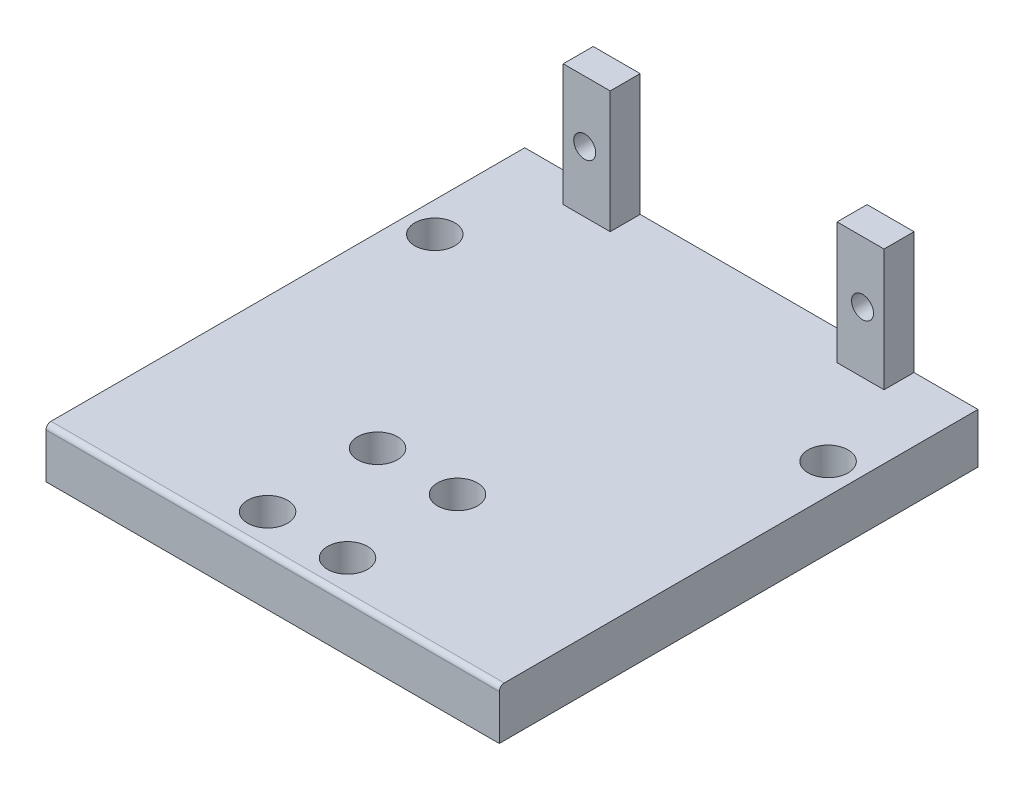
ISO-10303-21;
HEADER;
FILE_DESCRIPTION(('STEP AP214'),'2;1');
FILE_NAME('part.step','',(''),(''),'','','');
FILE_SCHEMA(('AUTOMOTIVE_DESIGN { 1 0 10303 214 1 1 1 1 }'));
ENDSEC;
DATA;
#1=APPLICATION_CONTEXT('core data for automotive mechanical design processes');
#2=APPLICATION_PROTOCOL_DEFINITION('international standard','automotive_design',2000,#1);
#3=PRODUCT_CONTEXT('',#1,'mechanical');
#4=PRODUCT('Part','Part','',(#3));
#5=PRODUCT_RELATED_PRODUCT_CATEGORY('part','',(#4));
#6=PRODUCT_DEFINITION_FORMATION('','',#4);
#7=PRODUCT_DEFINITION_CONTEXT('part definition',#1,'design');
#8=PRODUCT_DEFINITION('design','',#6,#7);
#9=PRODUCT_DEFINITION_SHAPE('','',#8);
#10=(LENGTH_UNIT() NAMED_UNIT(*) SI_UNIT(.MILLI.,.METRE.));
#11=(NAMED_UNIT(*) PLANE_ANGLE_UNIT() SI_UNIT($,.RADIAN.));
#12=(NAMED_UNIT(*) SI_UNIT($,.STERADIAN.) SOLID_ANGLE_UNIT());
#13=UNCERTAINTY_MEASURE_WITH_UNIT(LENGTH_MEASURE(1.E-05),#10,'distance_accuracy_value','');
#14=(GEOMETRIC_REPRESENTATION_CONTEXT(3) GLOBAL_UNCERTAINTY_ASSIGNED_CONTEXT((#13)) GLOBAL_UNIT_ASSIGNED_CONTEXT((#10,
#11,#12)) REPRESENTATION_CONTEXT('',''));
#15=CARTESIAN_POINT('',(0.,0.,0.));
#16=DIRECTION('',(0.,0.,1.));
#17=DIRECTION('',(1.,0.,0.));
#18=AXIS2_PLACEMENT_3D('',#15,#16,#17);
#19=CARTESIAN_POINT('',(0.,68.2,3.));
#20=DIRECTION('',(0.,1.,0.));
#21=DIRECTION('',(0.,0.,1.));
#22=AXIS2_PLACEMENT_3D('',#19,#20,#21);
#23=PLANE('',#22);
#24=DIRECTION('',(0.,0.,-1.));
#25=VECTOR('',#24,1.);
#26=CARTESIAN_POINT('',(49.5,68.2,47.9));
#27=LINE('',#26,#25);
#28=CARTESIAN_POINT('',(49.5,68.2,3.));
#29=VERTEX_POINT('',#28);
#30=CARTESIAN_POINT('',(49.5,68.2,0.));
#31=VERTEX_POINT('',#30);
#32=EDGE_CURVE('E184',#29,#31,#27,.T.);
#33=ORIENTED_EDGE('',*,*,#32,.F.);
#34=DIRECTION('',(1.,0.,0.));
#35=VECTOR('',#34,1.);
#36=CARTESIAN_POINT('',(0.,68.2,3.));
#37=LINE('',#36,#35);
#38=CARTESIAN_POINT('',(54.2,68.2,3.));
#39=VERTEX_POINT('',#38);
#40=EDGE_CURVE('E205',#29,#39,#37,.T.);
#41=ORIENTED_EDGE('',*,*,#40,.T.);
#42=DIRECTION('',(0.,0.,-1.));
#43=VECTOR('',#42,1.);
#44=CARTESIAN_POINT('',(54.2,68.2,3.));
#45=LINE('',#44,#43);
#46=CARTESIAN_POINT('',(54.2,68.2,0.));
#47=VERTEX_POINT('',#46);
#48=EDGE_CURVE('E227',#39,#47,#45,.T.);
#49=ORIENTED_EDGE('',*,*,#48,.T.);
#50=DIRECTION('',(1.,0.,0.));
#51=VECTOR('',#50,1.);
#52=CARTESIAN_POINT('',(0.,68.2,0.));
#53=LINE('',#52,#51);
#54=EDGE_CURVE('E218',#31,#47,#53,.T.);
#55=ORIENTED_EDGE('',*,*,#54,.F.);
#56=EDGE_LOOP('',(#33,#41,#49,#55));
#57=FACE_BOUND('',#56,.T.);
#58=ADVANCED_FACE('F41',(#57),#23,.T.);
#59=CARTESIAN_POINT('',(0.,0.,3.));
#60=DIRECTION('',(0.,0.,-1.));
#61=DIRECTION('',(-1.,0.,0.));
#62=AXIS2_PLACEMENT_3D('',#59,#60,#61);
#63=PLANE('',#62);
#64=CARTESIAN_POINT('',(52.05,62.1,3.));
#65=DIRECTION('',(0.,0.,-1.));
#66=DIRECTION('',(-1.,0.,0.));
#67=AXIS2_PLACEMENT_3D('',#64,#65,#66);
#68=CIRCLE('',#67,1.1);
#69=CARTESIAN_POINT('',(50.95,62.1,3.));
#70=VERTEX_POINT('',#69);
#71=EDGE_CURVE('E195',#70,#70,#68,.T.);
#72=ORIENTED_EDGE('',*,*,#71,.T.);
#73=EDGE_LOOP('',(#72));
#74=FACE_BOUND('',#73,.T.);
#75=ORIENTED_EDGE('',*,*,#40,.F.);
#76=DIRECTION('',(0.,-1.,0.));
#77=VECTOR('',#76,1.);
#78=CARTESIAN_POINT('',(49.5,0.,3.));
#79=LINE('',#78,#77);
#80=CARTESIAN_POINT('',(49.5,56.,3.));
#81=VERTEX_POINT('',#80);
#82=EDGE_CURVE('E11',#29,#81,#79,.T.);
#83=ORIENTED_EDGE('',*,*,#82,.T.);
#84=DIRECTION('',(1.,0.,0.));
#85=VECTOR('',#84,1.);
#86=CARTESIAN_POINT('',(0.,56.,3.));
#87=LINE('',#86,#85);
#88=CARTESIAN_POINT('',(54.2,56.,3.));
#89=VERTEX_POINT('',#88);
#90=EDGE_CURVE('E65',#81,#89,#87,.T.);
#91=ORIENTED_EDGE('',*,*,#90,.T.);
#92=DIRECTION('',(0.,1.,0.));
#93=VECTOR('',#92,1.);
#94=CARTESIAN_POINT('',(54.2,0.,3.));
#95=LINE('',#94,#93);
#96=EDGE_CURVE('E209',#89,#39,#95,.T.);
#97=ORIENTED_EDGE('',*,*,#96,.T.);
#98=EDGE_LOOP('',(#75,#83,#91,#97));
#99=FACE_BOUND('',#98,.T.);
#100=ADVANCED_FACE('F296',(#74,#99),#63,.F.);
#101=CARTESIAN_POINT('',(0.,56.,47.9));
#102=DIRECTION('',(0.,-1.,0.));
#103=DIRECTION('',(0.,0.,-1.));
#104=AXIS2_PLACEMENT_3D('',#101,#102,#103);
#105=PLANE('',#104);
#106=CARTESIAN_POINT('',(18.25,56.,12.));
#107=DIRECTION('',(0.,1.,0.));
#108=DIRECTION('',(0.,0.,1.));
#109=AXIS2_PLACEMENT_3D('',#106,#107,#108);
#110=CIRCLE('',#109,2.);
#111=CARTESIAN_POINT('',(18.25,56.,14.));
#112=VERTEX_POINT('',#111);
#113=EDGE_CURVE('E269',#112,#112,#110,.T.);
#114=ORIENTED_EDGE('',*,*,#113,.F.);
#115=EDGE_LOOP('',(#114));
#116=FACE_BOUND('',#115,.T.);
#117=CARTESIAN_POINT('',(57.6,56.,12.));
#118=DIRECTION('',(0.,1.,0.));
#119=DIRECTION('',(0.,0.,1.));
#120=AXIS2_PLACEMENT_3D('',#117,#118,#119);
#121=CIRCLE('',#120,2.);
#122=CARTESIAN_POINT('',(57.6,56.,14.));
#123=VERTEX_POINT('',#122);
#124=EDGE_CURVE('E275',#123,#123,#121,.T.);
#125=ORIENTED_EDGE('',*,*,#124,.F.);
#126=EDGE_LOOP('',(#125));
#127=FACE_BOUND('',#126,.T.);
#128=CARTESIAN_POINT('',(33.925,56.,44.40471485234));
#129=DIRECTION('',(0.,1.,0.));
#130=DIRECTION('',(0.,0.,1.));
#131=AXIS2_PLACEMENT_3D('',#128,#129,#130);
#132=CIRCLE('',#131,2.);
#133=CARTESIAN_POINT('',(33.925,56.,46.40471485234));
#134=VERTEX_POINT('',#133);
#135=EDGE_CURVE('E273',#134,#134,#132,.T.);
#136=ORIENTED_EDGE('',*,*,#135,.F.);
#137=EDGE_LOOP('',(#136));
#138=FACE_BOUND('',#137,.T.);
#139=CARTESIAN_POINT('',(41.925,56.,44.40471485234));
#140=DIRECTION('',(0.,1.,0.));
#141=DIRECTION('',(0.,0.,1.));
#142=AXIS2_PLACEMENT_3D('',#139,#140,#141);
#143=CIRCLE('',#142,2.);
#144=CARTESIAN_POINT('',(41.925,56.,46.40471485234));
#145=VERTEX_POINT('',#144);
#146=EDGE_CURVE('E285',#145,#145,#143,.T.);
#147=ORIENTED_EDGE('',*,*,#146,.F.);
#148=EDGE_LOOP('',(#147));
#149=FACE_BOUND('',#148,.T.);
#150=CARTESIAN_POINT('',(41.925,56.,33.40471485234));
#151=DIRECTION('',(0.,1.,0.));
#152=DIRECTION('',(0.,0.,1.));
#153=AXIS2_PLACEMENT_3D('',#150,#151,#152);
#154=CIRCLE('',#153,2.);
#155=CARTESIAN_POINT('',(41.925,56.,35.40471485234));
#156=VERTEX_POINT('',#155);
#157=EDGE_CURVE('E282',#156,#156,#154,.T.);
#158=ORIENTED_EDGE('',*,*,#157,.F.);
#159=EDGE_LOOP('',(#158));
#160=FACE_BOUND('',#159,.T.);
#161=CARTESIAN_POINT('',(33.925,56.,33.40471485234));
#162=DIRECTION('',(0.,1.,0.));
#163=DIRECTION('',(0.,0.,1.));
#164=AXIS2_PLACEMENT_3D('',#161,#162,#163);
#165=CIRCLE('',#164,2.);
#166=CARTESIAN_POINT('',(33.925,56.,35.40471485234));
#167=VERTEX_POINT('',#166);
#168=EDGE_CURVE('E177',#167,#167,#165,.T.);
#169=ORIENTED_EDGE('',*,*,#168,.F.);
#170=EDGE_LOOP('',(#169));
#171=FACE_BOUND('',#170,.T.);
#172=DIRECTION('',(-1.,0.,0.));
#173=VECTOR('',#172,1.);
#174=CARTESIAN_POINT('',(0.,56.,47.4));
#175=LINE('',#174,#173);
#176=CARTESIAN_POINT('',(15.25,56.,47.4));
#177=VERTEX_POINT('',#176);
#178=CARTESIAN_POINT('',(60.6,56.,47.4));
#179=VERTEX_POINT('',#178);
#180=EDGE_CURVE('E248',#177,#179,#175,.F.);
#181=ORIENTED_EDGE('',*,*,#180,.T.);
#182=DIRECTION('',(0.,0.,1.));
#183=VECTOR('',#182,1.);
#184=CARTESIAN_POINT('',(60.6,56.,0.));
#185=LINE('',#184,#183);
#186=CARTESIAN_POINT('',(60.6,56.,0.));
#187=VERTEX_POINT('',#186);
#188=EDGE_CURVE('E226',#187,#179,#185,.T.);
#189=ORIENTED_EDGE('',*,*,#188,.F.);
#190=DIRECTION('',(1.,0.,0.));
#191=VECTOR('',#190,1.);
#192=CARTESIAN_POINT('',(60.6,56.,0.));
#193=LINE('',#192,#191);
#194=CARTESIAN_POINT('',(54.2,56.,0.));
#195=VERTEX_POINT('',#194);
#196=EDGE_CURVE('E169',#195,#187,#193,.T.);
#197=ORIENTED_EDGE('',*,*,#196,.F.);
#198=DIRECTION('',(0.,0.,-1.));
#199=VECTOR('',#198,1.);
#200=CARTESIAN_POINT('',(54.2,56.,3.));
#201=LINE('',#200,#199);
#202=EDGE_CURVE('E224',#89,#195,#201,.T.);
#203=ORIENTED_EDGE('',*,*,#202,.F.);
#204=ORIENTED_EDGE('',*,*,#90,.F.);
#205=DIRECTION('',(0.,0.,-1.));
#206=VECTOR('',#205,1.);
#207=CARTESIAN_POINT('',(49.5,56.,47.9));
#208=LINE('',#207,#206);
#209=CARTESIAN_POINT('',(49.5,56.,0.));
#210=VERTEX_POINT('',#209);
#211=EDGE_CURVE('E183',#81,#210,#208,.T.);
#212=ORIENTED_EDGE('',*,*,#211,.T.);
#213=DIRECTION('',(-1.,0.,0.));
#214=VECTOR('',#213,1.);
#215=CARTESIAN_POINT('',(49.5,56.,0.));
#216=LINE('',#215,#214);
#217=CARTESIAN_POINT('',(26.8,56.,0.));
#218=VERTEX_POINT('',#217);
#219=EDGE_CURVE('E172',#210,#218,#216,.T.);
#220=ORIENTED_EDGE('',*,*,#219,.T.);
#221=DIRECTION('',(0.,0.,-1.));
#222=VECTOR('',#221,1.);
#223=CARTESIAN_POINT('',(26.8,56.,47.9));
#224=LINE('',#223,#222);
#225=CARTESIAN_POINT('',(26.8,56.,3.));
#226=VERTEX_POINT('',#225);
#227=EDGE_CURVE('E58',#226,#218,#224,.T.);
#228=ORIENTED_EDGE('',*,*,#227,.F.);
#229=CARTESIAN_POINT('',(22.1,56.,3.));
#230=VERTEX_POINT('',#229);
#231=EDGE_CURVE('E199',#230,#226,#87,.T.);
#232=ORIENTED_EDGE('',*,*,#231,.F.);
#233=DIRECTION('',(0.,0.,-1.));
#234=VECTOR('',#233,1.);
#235=CARTESIAN_POINT('',(22.1,56.,3.));
#236=LINE('',#235,#234);
#237=CARTESIAN_POINT('',(22.1,56.,0.));
#238=VERTEX_POINT('',#237);
#239=EDGE_CURVE('E167',#230,#238,#236,.T.);
#240=ORIENTED_EDGE('',*,*,#239,.T.);
#241=CARTESIAN_POINT('',(15.25,56.,0.));
#242=VERTEX_POINT('',#241);
#243=EDGE_CURVE('E159',#242,#238,#193,.T.);
#244=ORIENTED_EDGE('',*,*,#243,.F.);
#245=DIRECTION('',(0.,0.,1.));
#246=VECTOR('',#245,1.);
#247=CARTESIAN_POINT('',(15.25,56.,0.));
#248=LINE('',#247,#246);
#249=EDGE_CURVE('E139',#242,#177,#248,.T.);
#250=ORIENTED_EDGE('',*,*,#249,.T.);
#251=EDGE_LOOP('',(#181,#189,#197,#203,#204,#212,#220,#228,#232,#240,#244,#250));
#252=FACE_BOUND('',#251,.T.);
#253=ADVANCED_FACE('F166',(#116,#127,#138,#149,#160,#171,#252),#105,.F.);
#254=CARTESIAN_POINT('',(0.,0.,47.9));
#255=DIRECTION('',(0.,0.,-1.));
#256=DIRECTION('',(-1.,0.,0.));
#257=AXIS2_PLACEMENT_3D('',#254,#255,#256);
#258=PLANE('',#257);
#259=DIRECTION('',(0.,1.,0.));
#260=VECTOR('',#259,1.);
#261=CARTESIAN_POINT('',(15.25,51.,47.9));
#262=LINE('',#261,#260);
#263=CARTESIAN_POINT('',(15.25,51.,47.9));
#264=VERTEX_POINT('',#263);
#265=CARTESIAN_POINT('',(15.25,55.5,47.9));
#266=VERTEX_POINT('',#265);
#267=EDGE_CURVE('E163',#264,#266,#262,.T.);
#268=ORIENTED_EDGE('',*,*,#267,.F.);
#269=DIRECTION('',(1.,0.,0.));
#270=VECTOR('',#269,1.);
#271=CARTESIAN_POINT('',(70.6,51.,47.9));
#272=LINE('',#271,#270);
#273=CARTESIAN_POINT('',(60.6,51.,47.9));
#274=VERTEX_POINT('',#273);
#275=EDGE_CURVE('E245',#264,#274,#272,.T.);
#276=ORIENTED_EDGE('',*,*,#275,.T.);
#277=DIRECTION('',(0.,1.,0.));
#278=VECTOR('',#277,1.);
#279=CARTESIAN_POINT('',(60.6,51.,47.9));
#280=LINE('',#279,#278);
#281=CARTESIAN_POINT('',(60.6,55.5,47.9));
#282=VERTEX_POINT('',#281);
#283=EDGE_CURVE('E150',#274,#282,#280,.T.);
#284=ORIENTED_EDGE('',*,*,#283,.T.);
#285=DIRECTION('',(-1.,0.,0.));
#286=VECTOR('',#285,1.);
#287=CARTESIAN_POINT('',(0.,55.5,47.9));
#288=LINE('',#287,#286);
#289=EDGE_CURVE('E251',#282,#266,#288,.T.);
#290=ORIENTED_EDGE('',*,*,#289,.T.);
#291=EDGE_LOOP('',(#268,#276,#284,#290));
#292=FACE_BOUND('',#291,.T.);
#293=ADVANCED_FACE('F295',(#292),#258,.F.);
#294=CARTESIAN_POINT('',(0.,0.,0.));
#295=DIRECTION('',(0.,0.,-1.));
#296=DIRECTION('',(-1.,0.,0.));
#297=AXIS2_PLACEMENT_3D('',#294,#295,#296);
#298=PLANE('',#297);
#299=DIRECTION('',(0.,1.,0.));
#300=VECTOR('',#299,1.);
#301=CARTESIAN_POINT('',(26.8,68.2,0.));
#302=LINE('',#301,#300);
#303=CARTESIAN_POINT('',(26.8,68.2,0.));
#304=VERTEX_POINT('',#303);
#305=EDGE_CURVE('E181',#218,#304,#302,.T.);
#306=ORIENTED_EDGE('',*,*,#305,.F.);
#307=ORIENTED_EDGE('',*,*,#219,.F.);
#308=DIRECTION('',(0.,-1.,0.));
#309=VECTOR('',#308,1.);
#310=CARTESIAN_POINT('',(49.5,68.2,0.));
#311=LINE('',#310,#309);
#312=EDGE_CURVE('E168',#31,#210,#311,.T.);
#313=ORIENTED_EDGE('',*,*,#312,.F.);
#314=ORIENTED_EDGE('',*,*,#54,.T.);
#315=DIRECTION('',(0.,1.,0.));
#316=VECTOR('',#315,1.);
#317=CARTESIAN_POINT('',(54.2,0.,0.));
#318=LINE('',#317,#316);
#319=EDGE_CURVE('E196',#195,#47,#318,.T.);
#320=ORIENTED_EDGE('',*,*,#319,.F.);
#321=ORIENTED_EDGE('',*,*,#196,.T.);
#322=DIRECTION('',(0.,1.,0.));
#323=VECTOR('',#322,1.);
#324=CARTESIAN_POINT('',(60.6,51.,0.));
#325=LINE('',#324,#323);
#326=CARTESIAN_POINT('',(60.6,51.,0.));
#327=VERTEX_POINT('',#326);
#328=EDGE_CURVE('E238',#327,#187,#325,.T.);
#329=ORIENTED_EDGE('',*,*,#328,.F.);
#330=DIRECTION('',(1.,0.,0.));
#331=VECTOR('',#330,1.);
#332=CARTESIAN_POINT('',(70.6,51.,0.));
#333=LINE('',#332,#331);
#334=CARTESIAN_POINT('',(15.25,51.,0.));
#335=VERTEX_POINT('',#334);
#336=EDGE_CURVE('E162',#335,#327,#333,.T.);
#337=ORIENTED_EDGE('',*,*,#336,.F.);
#338=DIRECTION('',(0.,1.,0.));
#339=VECTOR('',#338,1.);
#340=CARTESIAN_POINT('',(15.25,51.,0.));
#341=LINE('',#340,#339);
#342=EDGE_CURVE('E142',#335,#242,#341,.T.);
#343=ORIENTED_EDGE('',*,*,#342,.T.);
#344=ORIENTED_EDGE('',*,*,#243,.T.);
#345=DIRECTION('',(0.,1.,0.));
#346=VECTOR('',#345,1.);
#347=CARTESIAN_POINT('',(22.1,0.,0.));
#348=LINE('',#347,#346);
#349=CARTESIAN_POINT('',(22.1,68.2,0.));
#350=VERTEX_POINT('',#349);
#351=EDGE_CURVE('E216',#238,#350,#348,.T.);
#352=ORIENTED_EDGE('',*,*,#351,.T.);
#353=EDGE_CURVE('E219',#350,#304,#53,.T.);
#354=ORIENTED_EDGE('',*,*,#353,.T.);
#355=EDGE_LOOP('',(#306,#307,#313,#314,#320,#321,#329,#337,#343,#344,#352,#354));
#356=FACE_BOUND('',#355,.T.);
#357=CARTESIAN_POINT('',(52.05,62.1,0.));
#358=DIRECTION('',(0.,0.,-1.));
#359=DIRECTION('',(-1.,0.,0.));
#360=AXIS2_PLACEMENT_3D('',#357,#358,#359);
#361=CIRCLE('',#360,1.1);
#362=CARTESIAN_POINT('',(50.95,62.1,0.));
#363=VERTEX_POINT('',#362);
#364=EDGE_CURVE('E213',#363,#363,#361,.T.);
#365=ORIENTED_EDGE('',*,*,#364,.F.);
#366=EDGE_LOOP('',(#365));
#367=FACE_BOUND('',#366,.T.);
#368=CARTESIAN_POINT('',(24.25,62.1,0.));
#369=DIRECTION('',(0.,0.,-1.));
#370=DIRECTION('',(-1.,0.,0.));
#371=AXIS2_PLACEMENT_3D('',#368,#369,#370);
#372=CIRCLE('',#371,1.09999999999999);
#373=CARTESIAN_POINT('',(23.15,62.1,0.));
#374=VERTEX_POINT('',#373);
#375=EDGE_CURVE('E186',#374,#374,#372,.T.);
#376=ORIENTED_EDGE('',*,*,#375,.F.);
#377=EDGE_LOOP('',(#376));
#378=FACE_BOUND('',#377,.T.);
#379=ADVANCED_FACE('F156',(#356,#367,#378),#298,.T.);
#380=CARTESIAN_POINT('',(70.6,51.,47.9));
#381=DIRECTION('',(0.,1.,0.));
#382=DIRECTION('',(-1.,0.,0.));
#383=AXIS2_PLACEMENT_3D('',#380,#381,#382);
#384=PLANE('',#383);
#385=CARTESIAN_POINT('',(18.25,51.,12.));
#386=DIRECTION('',(0.,1.,0.));
#387=DIRECTION('',(-1.,0.,0.));
#388=AXIS2_PLACEMENT_3D('',#385,#386,#387);
#389=CIRCLE('',#388,2.);
#390=CARTESIAN_POINT('',(16.25,51.,12.));
#391=VERTEX_POINT('',#390);
#392=EDGE_CURVE('E45',#391,#391,#389,.T.);
#393=ORIENTED_EDGE('',*,*,#392,.T.);
#394=EDGE_LOOP('',(#393));
#395=FACE_BOUND('',#394,.T.);
#396=CARTESIAN_POINT('',(57.6,51.,12.));
#397=DIRECTION('',(0.,1.,0.));
#398=DIRECTION('',(-1.,0.,0.));
#399=AXIS2_PLACEMENT_3D('',#396,#397,#398);
#400=CIRCLE('',#399,2.);
#401=CARTESIAN_POINT('',(55.6,51.,12.));
#402=VERTEX_POINT('',#401);
#403=EDGE_CURVE('E267',#402,#402,#400,.T.);
#404=ORIENTED_EDGE('',*,*,#403,.T.);
#405=EDGE_LOOP('',(#404));
#406=FACE_BOUND('',#405,.T.);
#407=CARTESIAN_POINT('',(33.925,51.,44.40471485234));
#408=DIRECTION('',(0.,1.,0.));
#409=DIRECTION('',(-1.,0.,0.));
#410=AXIS2_PLACEMENT_3D('',#407,#408,#409);
#411=CIRCLE('',#410,2.);
#412=CARTESIAN_POINT('',(31.925,51.,44.40471485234));
#413=VERTEX_POINT('',#412);
#414=EDGE_CURVE('E175',#413,#413,#411,.T.);
#415=ORIENTED_EDGE('',*,*,#414,.T.);
#416=EDGE_LOOP('',(#415));
#417=FACE_BOUND('',#416,.T.);
#418=CARTESIAN_POINT('',(41.925,51.,44.40471485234));
#419=DIRECTION('',(0.,1.,0.));
#420=DIRECTION('',(-1.,0.,0.));
#421=AXIS2_PLACEMENT_3D('',#418,#419,#420);
#422=CIRCLE('',#421,2.);
#423=CARTESIAN_POINT('',(39.925,51.,44.40471485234));
#424=VERTEX_POINT('',#423);
#425=EDGE_CURVE('E263',#424,#424,#422,.T.);
#426=ORIENTED_EDGE('',*,*,#425,.T.);
#427=EDGE_LOOP('',(#426));
#428=FACE_BOUND('',#427,.T.);
#429=CARTESIAN_POINT('',(41.925,51.,33.40471485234));
#430=DIRECTION('',(0.,1.,0.));
#431=DIRECTION('',(-1.,0.,0.));
#432=AXIS2_PLACEMENT_3D('',#429,#430,#431);
#433=CIRCLE('',#432,2.);
#434=CARTESIAN_POINT('',(39.925,51.,33.40471485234));
#435=VERTEX_POINT('',#434);
#436=EDGE_CURVE('E260',#435,#435,#433,.T.);
#437=ORIENTED_EDGE('',*,*,#436,.T.);
#438=EDGE_LOOP('',(#437));
#439=FACE_BOUND('',#438,.T.);
#440=CARTESIAN_POINT('',(33.925,51.,33.40471485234));
#441=DIRECTION('',(0.,1.,0.));
#442=DIRECTION('',(-1.,0.,0.));
#443=AXIS2_PLACEMENT_3D('',#440,#441,#442);
#444=CIRCLE('',#443,2.);
#445=CARTESIAN_POINT('',(31.925,51.,33.40471485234));
#446=VERTEX_POINT('',#445);
#447=EDGE_CURVE('E257',#446,#446,#444,.T.);
#448=ORIENTED_EDGE('',*,*,#447,.T.);
#449=EDGE_LOOP('',(#448));
#450=FACE_BOUND('',#449,.T.);
#451=ORIENTED_EDGE('',*,*,#275,.F.);
#452=DIRECTION('',(0.,0.,1.));
#453=VECTOR('',#452,1.);
#454=CARTESIAN_POINT('',(15.25,51.,0.));
#455=LINE('',#454,#453);
#456=EDGE_CURVE('E149',#335,#264,#455,.T.);
#457=ORIENTED_EDGE('',*,*,#456,.F.);
#458=ORIENTED_EDGE('',*,*,#336,.T.);
#459=DIRECTION('',(0.,0.,1.));
#460=VECTOR('',#459,1.);
#461=CARTESIAN_POINT('',(60.6,51.,0.));
#462=LINE('',#461,#460);
#463=EDGE_CURVE('E236',#327,#274,#462,.T.);
#464=ORIENTED_EDGE('',*,*,#463,.T.);
#465=EDGE_LOOP('',(#451,#457,#458,#464));
#466=FACE_BOUND('',#465,.T.);
#467=ADVANCED_FACE('F314',(#395,#406,#417,#428,#439,#450,#466),#384,.F.);
#468=CARTESIAN_POINT('',(0.,55.5,47.4));
#469=DIRECTION('',(-1.,0.,0.));
#470=DIRECTION('',(0.,0.,1.));
#471=AXIS2_PLACEMENT_3D('',#468,#469,#470);
#472=CYLINDRICAL_SURFACE('',#471,0.5);
#473=ORIENTED_EDGE('',*,*,#180,.F.);
#474=CARTESIAN_POINT('',(15.25,55.5,47.4));
#475=DIRECTION('',(-1.,0.,0.));
#476=DIRECTION('',(0.,0.,1.));
#477=AXIS2_PLACEMENT_3D('',#474,#475,#476);
#478=CIRCLE('',#477,0.5);
#479=EDGE_CURVE('E145',#177,#266,#478,.F.);
#480=ORIENTED_EDGE('',*,*,#479,.T.);
#481=ORIENTED_EDGE('',*,*,#289,.F.);
#482=CARTESIAN_POINT('',(60.6,55.5,47.4));
#483=DIRECTION('',(-1.,0.,0.));
#484=DIRECTION('',(0.,0.,1.));
#485=AXIS2_PLACEMENT_3D('',#482,#483,#484);
#486=CIRCLE('',#485,0.5);
#487=EDGE_CURVE('E234',#179,#282,#486,.F.);
#488=ORIENTED_EDGE('',*,*,#487,.F.);
#489=EDGE_LOOP('',(#473,#480,#481,#488));
#490=FACE_BOUND('',#489,.T.);
#491=ADVANCED_FACE('F43',(#490),#472,.T.);
#492=CARTESIAN_POINT('',(60.6,51.,0.));
#493=DIRECTION('',(-1.,0.,0.));
#494=DIRECTION('',(0.,0.,1.));
#495=AXIS2_PLACEMENT_3D('',#492,#493,#494);
#496=PLANE('',#495);
#497=ORIENTED_EDGE('',*,*,#283,.F.);
#498=ORIENTED_EDGE('',*,*,#463,.F.);
#499=ORIENTED_EDGE('',*,*,#328,.T.);
#500=ORIENTED_EDGE('',*,*,#188,.T.);
#501=ORIENTED_EDGE('',*,*,#487,.T.);
#502=EDGE_LOOP('',(#497,#498,#499,#500,#501));
#503=FACE_BOUND('',#502,.T.);
#504=ADVANCED_FACE('F328',(#503),#496,.F.);
#505=CARTESIAN_POINT('',(15.25,51.,0.));
#506=DIRECTION('',(-1.,0.,0.));
#507=DIRECTION('',(0.,0.,1.));
#508=AXIS2_PLACEMENT_3D('',#505,#506,#507);
#509=PLANE('',#508);
#510=ORIENTED_EDGE('',*,*,#479,.F.);
#511=ORIENTED_EDGE('',*,*,#249,.F.);
#512=ORIENTED_EDGE('',*,*,#342,.F.);
#513=ORIENTED_EDGE('',*,*,#456,.T.);
#514=ORIENTED_EDGE('',*,*,#267,.T.);
#515=EDGE_LOOP('',(#510,#511,#512,#513,#514));
#516=FACE_BOUND('',#515,.T.);
#517=ADVANCED_FACE('F141',(#516),#509,.T.);
#518=CARTESIAN_POINT('',(54.2,0.,3.));
#519=DIRECTION('',(-1.,0.,0.));
#520=DIRECTION('',(0.,0.,1.));
#521=AXIS2_PLACEMENT_3D('',#518,#519,#520);
#522=PLANE('',#521);
#523=ORIENTED_EDGE('',*,*,#319,.T.);
#524=ORIENTED_EDGE('',*,*,#48,.F.);
#525=ORIENTED_EDGE('',*,*,#96,.F.);
#526=ORIENTED_EDGE('',*,*,#202,.T.);
#527=EDGE_LOOP('',(#523,#524,#525,#526));
#528=FACE_BOUND('',#527,.T.);
#529=ADVANCED_FACE('F333',(#528),#522,.F.);
#530=DIRECTION('',(0.,0.,-1.));
#531=VECTOR('',#530,1.);
#532=CARTESIAN_POINT('',(26.8,68.2,47.9));
#533=LINE('',#532,#531);
#534=CARTESIAN_POINT('',(26.8,68.2,3.));
#535=VERTEX_POINT('',#534);
#536=EDGE_CURVE('E187',#535,#304,#533,.T.);
#537=ORIENTED_EDGE('',*,*,#536,.T.);
#538=ORIENTED_EDGE('',*,*,#353,.F.);
#539=DIRECTION('',(0.,0.,-1.));
#540=VECTOR('',#539,1.);
#541=CARTESIAN_POINT('',(22.1,68.2,3.));
#542=LINE('',#541,#540);
#543=CARTESIAN_POINT('',(22.1,68.2,3.));
#544=VERTEX_POINT('',#543);
#545=EDGE_CURVE('E230',#544,#350,#542,.T.);
#546=ORIENTED_EDGE('',*,*,#545,.F.);
#547=EDGE_CURVE('E206',#544,#535,#37,.T.);
#548=ORIENTED_EDGE('',*,*,#547,.T.);
#549=EDGE_LOOP('',(#537,#538,#546,#548));
#550=FACE_BOUND('',#549,.T.);
#551=ADVANCED_FACE('F342',(#550),#23,.T.);
#552=CARTESIAN_POINT('',(52.05,62.1,3.));
#553=DIRECTION('',(0.,0.,-1.));
#554=DIRECTION('',(-1.,0.,0.));
#555=AXIS2_PLACEMENT_3D('',#552,#553,#554);
#556=CYLINDRICAL_SURFACE('',#555,1.1);
#557=ORIENTED_EDGE('',*,*,#71,.F.);
#558=EDGE_LOOP('',(#557));
#559=FACE_BOUND('',#558,.T.);
#560=ORIENTED_EDGE('',*,*,#364,.T.);
#561=EDGE_LOOP('',(#560));
#562=FACE_BOUND('',#561,.T.);
#563=ADVANCED_FACE('F358',(#559,#562),#556,.F.);
#564=CARTESIAN_POINT('',(24.25,62.1,3.));
#565=DIRECTION('',(0.,0.,-1.));
#566=DIRECTION('',(-1.,0.,0.));
#567=AXIS2_PLACEMENT_3D('',#564,#565,#566);
#568=CYLINDRICAL_SURFACE('',#567,1.09999999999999);
#569=CARTESIAN_POINT('',(24.25,62.1,3.));
#570=DIRECTION('',(0.,0.,-1.));
#571=DIRECTION('',(-1.,0.,0.));
#572=AXIS2_PLACEMENT_3D('',#569,#570,#571);
#573=CIRCLE('',#572,1.09999999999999);
#574=CARTESIAN_POINT('',(23.15,62.1,3.));
#575=VERTEX_POINT('',#574);
#576=EDGE_CURVE('E192',#575,#575,#573,.T.);
#577=ORIENTED_EDGE('',*,*,#576,.F.);
#578=EDGE_LOOP('',(#577));
#579=FACE_BOUND('',#578,.T.);
#580=ORIENTED_EDGE('',*,*,#375,.T.);
#581=EDGE_LOOP('',(#580));
#582=FACE_BOUND('',#581,.T.);
#583=ADVANCED_FACE('F350',(#579,#582),#568,.F.);
#584=CARTESIAN_POINT('',(22.1,0.,3.));
#585=DIRECTION('',(-1.,0.,0.));
#586=DIRECTION('',(0.,0.,1.));
#587=AXIS2_PLACEMENT_3D('',#584,#585,#586);
#588=PLANE('',#587);
#589=ORIENTED_EDGE('',*,*,#351,.F.);
#590=ORIENTED_EDGE('',*,*,#239,.F.);
#591=DIRECTION('',(0.,1.,0.));
#592=VECTOR('',#591,1.);
#593=CARTESIAN_POINT('',(22.1,0.,3.));
#594=LINE('',#593,#592);
#595=EDGE_CURVE('E202',#230,#544,#594,.T.);
#596=ORIENTED_EDGE('',*,*,#595,.T.);
#597=ORIENTED_EDGE('',*,*,#545,.T.);
#598=EDGE_LOOP('',(#589,#590,#596,#597));
#599=FACE_BOUND('',#598,.T.);
#600=ADVANCED_FACE('F348',(#599),#588,.T.);
#601=ORIENTED_EDGE('',*,*,#576,.T.);
#602=EDGE_LOOP('',(#601));
#603=FACE_BOUND('',#602,.T.);
#604=ORIENTED_EDGE('',*,*,#231,.T.);
#605=DIRECTION('',(0.,1.,0.));
#606=VECTOR('',#605,1.);
#607=CARTESIAN_POINT('',(26.8,0.,3.));
#608=LINE('',#607,#606);
#609=EDGE_CURVE('E50',#226,#535,#608,.T.);
#610=ORIENTED_EDGE('',*,*,#609,.T.);
#611=ORIENTED_EDGE('',*,*,#547,.F.);
#612=ORIENTED_EDGE('',*,*,#595,.F.);
#613=EDGE_LOOP('',(#604,#610,#611,#612));
#614=FACE_BOUND('',#613,.T.);
#615=ADVANCED_FACE('F346',(#603,#614),#63,.F.);
#616=CARTESIAN_POINT('',(49.5,68.2,47.9));
#617=DIRECTION('',(1.,0.,0.));
#618=DIRECTION('',(0.,0.,-1.));
#619=AXIS2_PLACEMENT_3D('',#616,#617,#618);
#620=PLANE('',#619);
#621=ORIENTED_EDGE('',*,*,#32,.T.);
#622=ORIENTED_EDGE('',*,*,#312,.T.);
#623=ORIENTED_EDGE('',*,*,#211,.F.);
#624=ORIENTED_EDGE('',*,*,#82,.F.);
#625=EDGE_LOOP('',(#621,#622,#623,#624));
#626=FACE_BOUND('',#625,.T.);
#627=ADVANCED_FACE('F337',(#626),#620,.F.);
#628=CARTESIAN_POINT('',(26.8,68.2,47.9));
#629=DIRECTION('',(-1.,0.,0.));
#630=DIRECTION('',(0.,0.,1.));
#631=AXIS2_PLACEMENT_3D('',#628,#629,#630);
#632=PLANE('',#631);
#633=ORIENTED_EDGE('',*,*,#227,.T.);
#634=ORIENTED_EDGE('',*,*,#305,.T.);
#635=ORIENTED_EDGE('',*,*,#536,.F.);
#636=ORIENTED_EDGE('',*,*,#609,.F.);
#637=EDGE_LOOP('',(#633,#634,#635,#636));
#638=FACE_BOUND('',#637,.T.);
#639=ADVANCED_FACE('F310',(#638),#632,.F.);
#640=CARTESIAN_POINT('',(33.925,46.,33.40471485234));
#641=DIRECTION('',(0.,1.,0.));
#642=DIRECTION('',(0.,0.,1.));
#643=AXIS2_PLACEMENT_3D('',#640,#641,#642);
#644=CYLINDRICAL_SURFACE('',#643,2.);
#645=ORIENTED_EDGE('',*,*,#168,.T.);
#646=EDGE_LOOP('',(#645));
#647=FACE_BOUND('',#646,.T.);
#648=ORIENTED_EDGE('',*,*,#447,.F.);
#649=EDGE_LOOP('',(#648));
#650=FACE_BOUND('',#649,.T.);
#651=ADVANCED_FACE('F306',(#647,#650),#644,.F.);
#652=CARTESIAN_POINT('',(41.925,46.,33.40471485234));
#653=DIRECTION('',(0.,1.,0.));
#654=DIRECTION('',(0.,0.,1.));
#655=AXIS2_PLACEMENT_3D('',#652,#653,#654);
#656=CYLINDRICAL_SURFACE('',#655,2.);
#657=ORIENTED_EDGE('',*,*,#157,.T.);
#658=EDGE_LOOP('',(#657));
#659=FACE_BOUND('',#658,.T.);
#660=ORIENTED_EDGE('',*,*,#436,.F.);
#661=EDGE_LOOP('',(#660));
#662=FACE_BOUND('',#661,.T.);
#663=ADVANCED_FACE('F309',(#659,#662),#656,.F.);
#664=CARTESIAN_POINT('',(41.925,46.,44.40471485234));
#665=DIRECTION('',(0.,1.,0.));
#666=DIRECTION('',(0.,0.,1.));
#667=AXIS2_PLACEMENT_3D('',#664,#665,#666);
#668=CYLINDRICAL_SURFACE('',#667,2.);
#669=ORIENTED_EDGE('',*,*,#146,.T.);
#670=EDGE_LOOP('',(#669));
#671=FACE_BOUND('',#670,.T.);
#672=ORIENTED_EDGE('',*,*,#425,.F.);
#673=EDGE_LOOP('',(#672));
#674=FACE_BOUND('',#673,.T.);
#675=ADVANCED_FACE('F388',(#671,#674),#668,.F.);
#676=CARTESIAN_POINT('',(33.925,46.,44.40471485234));
#677=DIRECTION('',(0.,1.,0.));
#678=DIRECTION('',(0.,0.,1.));
#679=AXIS2_PLACEMENT_3D('',#676,#677,#678);
#680=CYLINDRICAL_SURFACE('',#679,2.);
#681=ORIENTED_EDGE('',*,*,#135,.T.);
#682=EDGE_LOOP('',(#681));
#683=FACE_BOUND('',#682,.T.);
#684=ORIENTED_EDGE('',*,*,#414,.F.);
#685=EDGE_LOOP('',(#684));
#686=FACE_BOUND('',#685,.T.);
#687=ADVANCED_FACE('F290',(#683,#686),#680,.F.);
#688=CARTESIAN_POINT('',(57.6,46.,12.));
#689=DIRECTION('',(0.,1.,0.));
#690=DIRECTION('',(0.,0.,1.));
#691=AXIS2_PLACEMENT_3D('',#688,#689,#690);
#692=CYLINDRICAL_SURFACE('',#691,2.);
#693=ORIENTED_EDGE('',*,*,#124,.T.);
#694=EDGE_LOOP('',(#693));
#695=FACE_BOUND('',#694,.T.);
#696=ORIENTED_EDGE('',*,*,#403,.F.);
#697=EDGE_LOOP('',(#696));
#698=FACE_BOUND('',#697,.T.);
#699=ADVANCED_FACE('F387',(#695,#698),#692,.F.);
#700=CARTESIAN_POINT('',(18.25,46.,12.));
#701=DIRECTION('',(0.,1.,0.));
#702=DIRECTION('',(0.,0.,1.));
#703=AXIS2_PLACEMENT_3D('',#700,#701,#702);
#704=CYLINDRICAL_SURFACE('',#703,2.);
#705=ORIENTED_EDGE('',*,*,#113,.T.);
#706=EDGE_LOOP('',(#705));
#707=FACE_BOUND('',#706,.T.);
#708=ORIENTED_EDGE('',*,*,#392,.F.);
#709=EDGE_LOOP('',(#708));
#710=FACE_BOUND('',#709,.T.);
#711=ADVANCED_FACE('F397',(#707,#710),#704,.F.);
#712=CLOSED_SHELL('',(#58,#100,#253,#293,#379,#467,#491,#504,#517,#529,#551,#563,#583,#600,#615,
#627,#639,#651,#663,#675,#687,#699,#711));
#713=MANIFOLD_SOLID_BREP('B2',#712);
#714=ADVANCED_BREP_SHAPE_REPRESENTATION('',(#18,#713),#14);
#715=SHAPE_DEFINITION_REPRESENTATION(#9,#714);
ENDSEC;
END-ISO-10303-21;
